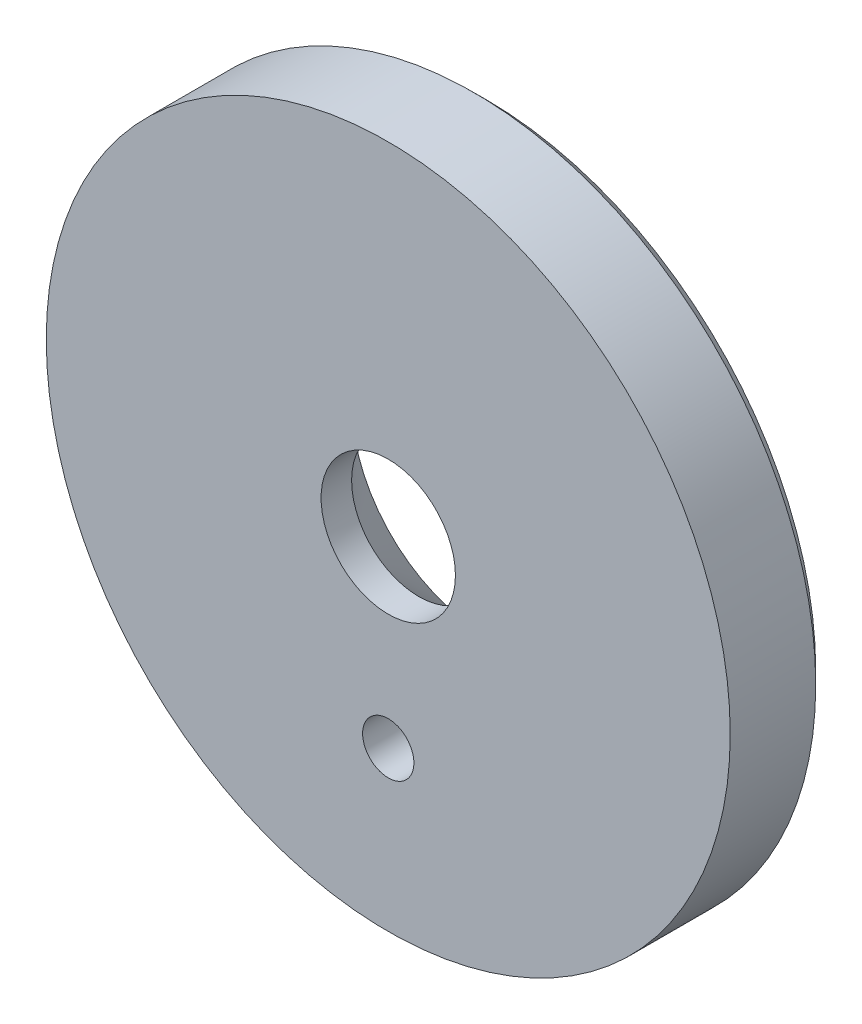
ISO-10303-21;
HEADER;
FILE_DESCRIPTION(('STEP AP214'),'2;1');
FILE_NAME('part.step','',(''),(''),'','','');
FILE_SCHEMA(('AUTOMOTIVE_DESIGN { 1 0 10303 214 1 1 1 1 }'));
ENDSEC;
DATA;
#1=APPLICATION_CONTEXT('core data for automotive mechanical design processes');
#2=APPLICATION_PROTOCOL_DEFINITION('international standard','automotive_design',2000,#1);
#3=PRODUCT_CONTEXT('',#1,'mechanical');
#4=PRODUCT('Part','Part','',(#3));
#5=PRODUCT_RELATED_PRODUCT_CATEGORY('part','',(#4));
#6=PRODUCT_DEFINITION_FORMATION('','',#4);
#7=PRODUCT_DEFINITION_CONTEXT('part definition',#1,'design');
#8=PRODUCT_DEFINITION('design','',#6,#7);
#9=PRODUCT_DEFINITION_SHAPE('','',#8);
#10=(LENGTH_UNIT() NAMED_UNIT(*) SI_UNIT(.MILLI.,.METRE.));
#11=(NAMED_UNIT(*) PLANE_ANGLE_UNIT() SI_UNIT($,.RADIAN.));
#12=(NAMED_UNIT(*) SI_UNIT($,.STERADIAN.) SOLID_ANGLE_UNIT());
#13=UNCERTAINTY_MEASURE_WITH_UNIT(LENGTH_MEASURE(1.E-05),#10,'distance_accuracy_value','');
#14=(GEOMETRIC_REPRESENTATION_CONTEXT(3) GLOBAL_UNCERTAINTY_ASSIGNED_CONTEXT((#13)) GLOBAL_UNIT_ASSIGNED_CONTEXT((#10,
#11,#12)) REPRESENTATION_CONTEXT('',''));
#15=CARTESIAN_POINT('',(0.,0.,0.));
#16=DIRECTION('',(0.,0.,1.));
#17=DIRECTION('',(1.,0.,0.));
#18=AXIS2_PLACEMENT_3D('',#15,#16,#17);
#19=CARTESIAN_POINT('',(0.,0.,-4.));
#20=DIRECTION('',(0.,0.,1.));
#21=DIRECTION('',(1.,0.,0.));
#22=AXIS2_PLACEMENT_3D('',#19,#20,#21);
#23=CYLINDRICAL_SURFACE('',#22,14.);
#24=CARTESIAN_POINT('',(0.,0.,-3.49999999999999));
#25=DIRECTION('',(0.,0.,1.));
#26=DIRECTION('',(1.,0.,0.));
#27=AXIS2_PLACEMENT_3D('',#24,#25,#26);
#28=CIRCLE('',#27,14.);
#29=CARTESIAN_POINT('',(14.,0.,-3.49999999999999));
#30=VERTEX_POINT('',#29);
#31=EDGE_CURVE('E44',#30,#30,#28,.T.);
#32=ORIENTED_EDGE('',*,*,#31,.T.);
#33=EDGE_LOOP('',(#32));
#34=FACE_BOUND('',#33,.T.);
#35=CARTESIAN_POINT('',(0.,0.,0.));
#36=DIRECTION('',(0.,0.,1.));
#37=DIRECTION('',(1.,0.,0.));
#38=AXIS2_PLACEMENT_3D('',#35,#36,#37);
#39=CIRCLE('',#38,14.);
#40=CARTESIAN_POINT('',(14.,0.,0.));
#41=VERTEX_POINT('',#40);
#42=EDGE_CURVE('E48',#41,#41,#39,.T.);
#43=ORIENTED_EDGE('',*,*,#42,.F.);
#44=EDGE_LOOP('',(#43));
#45=FACE_BOUND('',#44,.T.);
#46=ADVANCED_FACE('F37',(#34,#45),#23,.T.);
#47=CARTESIAN_POINT('',(0.,0.,-4.));
#48=DIRECTION('',(0.,0.,1.));
#49=DIRECTION('',(1.,0.,0.));
#50=AXIS2_PLACEMENT_3D('',#47,#48,#49);
#51=PLANE('',#50);
#52=CARTESIAN_POINT('',(0.,-7.5,-4.00000000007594));
#53=DIRECTION('',(0.,0.,-1.));
#54=DIRECTION('',(-1.,0.,0.));
#55=AXIS2_PLACEMENT_3D('',#52,#53,#54);
#56=CIRCLE('',#55,1.05);
#57=CARTESIAN_POINT('',(-1.05,-7.5,-4.00000000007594));
#58=VERTEX_POINT('',#57);
#59=EDGE_CURVE('E64',#58,#58,#56,.T.);
#60=ORIENTED_EDGE('',*,*,#59,.F.);
#61=EDGE_LOOP('',(#60));
#62=FACE_BOUND('',#61,.T.);
#63=CARTESIAN_POINT('',(0.,0.,-4.));
#64=DIRECTION('',(0.,0.,1.));
#65=DIRECTION('',(1.,0.,0.));
#66=AXIS2_PLACEMENT_3D('',#63,#64,#65);
#67=CIRCLE('',#66,13.5);
#68=CARTESIAN_POINT('',(13.5,0.,-4.));
#69=VERTEX_POINT('',#68);
#70=EDGE_CURVE('E10',#69,#69,#67,.F.);
#71=ORIENTED_EDGE('',*,*,#70,.T.);
#72=EDGE_LOOP('',(#71));
#73=FACE_BOUND('',#72,.T.);
#74=CARTESIAN_POINT('',(0.,0.,-4.));
#75=DIRECTION('',(0.,0.,-1.));
#76=DIRECTION('',(-1.,0.,0.));
#77=AXIS2_PLACEMENT_3D('',#74,#75,#76);
#78=CIRCLE('',#77,5.5);
#79=CARTESIAN_POINT('',(-5.5,0.,-4.));
#80=VERTEX_POINT('',#79);
#81=EDGE_CURVE('E57',#80,#80,#78,.T.);
#82=ORIENTED_EDGE('',*,*,#81,.F.);
#83=EDGE_LOOP('',(#82));
#84=FACE_BOUND('',#83,.T.);
#85=ADVANCED_FACE('F79',(#62,#73,#84),#51,.F.);
#86=CARTESIAN_POINT('',(0.,0.,0.));
#87=DIRECTION('',(0.,0.,1.));
#88=DIRECTION('',(1.,0.,0.));
#89=AXIS2_PLACEMENT_3D('',#86,#87,#88);
#90=PLANE('',#89);
#91=CARTESIAN_POINT('',(0.,-7.5,0.));
#92=DIRECTION('',(0.,0.,-1.));
#93=DIRECTION('',(-1.,0.,0.));
#94=AXIS2_PLACEMENT_3D('',#91,#92,#93);
#95=CIRCLE('',#94,1.05);
#96=CARTESIAN_POINT('',(-1.05,-7.5,0.));
#97=VERTEX_POINT('',#96);
#98=EDGE_CURVE('E63',#97,#97,#95,.T.);
#99=ORIENTED_EDGE('',*,*,#98,.T.);
#100=EDGE_LOOP('',(#99));
#101=FACE_BOUND('',#100,.T.);
#102=CARTESIAN_POINT('',(0.,0.,0.));
#103=DIRECTION('',(0.,0.,1.));
#104=DIRECTION('',(1.,0.,0.));
#105=AXIS2_PLACEMENT_3D('',#102,#103,#104);
#106=CIRCLE('',#105,2.75);
#107=CARTESIAN_POINT('',(2.75,0.,0.));
#108=VERTEX_POINT('',#107);
#109=EDGE_CURVE('E52',#108,#108,#106,.T.);
#110=ORIENTED_EDGE('',*,*,#109,.F.);
#111=EDGE_LOOP('',(#110));
#112=FACE_BOUND('',#111,.T.);
#113=ORIENTED_EDGE('',*,*,#42,.T.);
#114=EDGE_LOOP('',(#113));
#115=FACE_BOUND('',#114,.T.);
#116=ADVANCED_FACE('F70',(#101,#112,#115),#90,.T.);
#117=CARTESIAN_POINT('',(0.,0.,-4.));
#118=DIRECTION('',(0.,0.,1.));
#119=DIRECTION('',(1.,0.,0.));
#120=AXIS2_PLACEMENT_3D('',#117,#118,#119);
#121=CYLINDRICAL_SURFACE('',#120,2.75);
#122=CARTESIAN_POINT('',(0.,0.,-1.24999999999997));
#123=DIRECTION('',(0.,0.,-1.));
#124=DIRECTION('',(-1.,0.,0.));
#125=AXIS2_PLACEMENT_3D('',#122,#123,#124);
#126=CIRCLE('',#125,2.75);
#127=CARTESIAN_POINT('',(-2.75,0.,-1.24999999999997));
#128=VERTEX_POINT('',#127);
#129=EDGE_CURVE('E60',#128,#128,#126,.T.);
#130=ORIENTED_EDGE('',*,*,#129,.T.);
#131=EDGE_LOOP('',(#130));
#132=FACE_BOUND('',#131,.T.);
#133=ORIENTED_EDGE('',*,*,#109,.T.);
#134=EDGE_LOOP('',(#133));
#135=FACE_BOUND('',#134,.T.);
#136=ADVANCED_FACE('F87',(#132,#135),#121,.F.);
#137=CARTESIAN_POINT('',(0.,0.,-4.));
#138=DIRECTION('',(0.,0.,-1.));
#139=DIRECTION('',(-1.,0.,0.));
#140=AXIS2_PLACEMENT_3D('',#137,#138,#139);
#141=CONICAL_SURFACE('',#140,5.5,0.785398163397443);
#142=ORIENTED_EDGE('',*,*,#129,.F.);
#143=EDGE_LOOP('',(#142));
#144=FACE_BOUND('',#143,.T.);
#145=ORIENTED_EDGE('',*,*,#81,.T.);
#146=EDGE_LOOP('',(#145));
#147=FACE_BOUND('',#146,.T.);
#148=ADVANCED_FACE('F85',(#144,#147),#141,.F.);
#149=CARTESIAN_POINT('',(0.,0.,-3.49999999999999));
#150=DIRECTION('',(0.,0.,1.));
#151=DIRECTION('',(1.,0.,0.));
#152=AXIS2_PLACEMENT_3D('',#149,#150,#151);
#153=CONICAL_SURFACE('',#152,14.,0.785398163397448);
#154=ORIENTED_EDGE('',*,*,#70,.F.);
#155=EDGE_LOOP('',(#154));
#156=FACE_BOUND('',#155,.T.);
#157=ORIENTED_EDGE('',*,*,#31,.F.);
#158=EDGE_LOOP('',(#157));
#159=FACE_BOUND('',#158,.T.);
#160=ADVANCED_FACE('F39',(#156,#159),#153,.T.);
#161=CARTESIAN_POINT('',(0.,-7.5,0.));
#162=DIRECTION('',(0.,0.,-1.));
#163=DIRECTION('',(-1.,0.,0.));
#164=AXIS2_PLACEMENT_3D('',#161,#162,#163);
#165=CYLINDRICAL_SURFACE('',#164,1.05);
#166=ORIENTED_EDGE('',*,*,#98,.F.);
#167=EDGE_LOOP('',(#166));
#168=FACE_BOUND('',#167,.T.);
#169=ORIENTED_EDGE('',*,*,#59,.T.);
#170=EDGE_LOOP('',(#169));
#171=FACE_BOUND('',#170,.T.);
#172=ADVANCED_FACE('F73',(#168,#171),#165,.F.);
#173=CLOSED_SHELL('',(#46,#85,#116,#136,#148,#160,#172));
#174=MANIFOLD_SOLID_BREP('B2',#173);
#175=ADVANCED_BREP_SHAPE_REPRESENTATION('',(#18,#174),#14);
#176=SHAPE_DEFINITION_REPRESENTATION(#9,#175);
ENDSEC;
END-ISO-10303-21;
